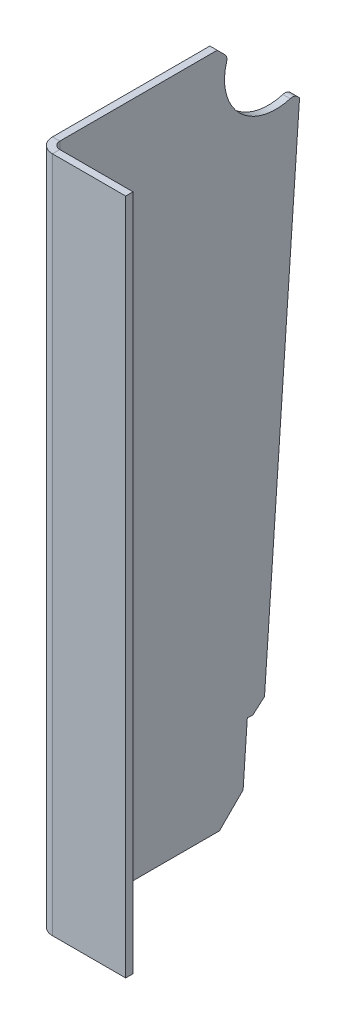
ISO-10303-21;
HEADER;
FILE_DESCRIPTION(('STEP AP214'),'2;1');
FILE_NAME('part.step','',(''),(''),'','','');
FILE_SCHEMA(('AUTOMOTIVE_DESIGN { 1 0 10303 214 1 1 1 1 }'));
ENDSEC;
DATA;
#1=APPLICATION_CONTEXT('core data for automotive mechanical design processes');
#2=APPLICATION_PROTOCOL_DEFINITION('international standard','automotive_design',2000,#1);
#3=PRODUCT_CONTEXT('',#1,'mechanical');
#4=PRODUCT('Part','Part','',(#3));
#5=PRODUCT_RELATED_PRODUCT_CATEGORY('part','',(#4));
#6=PRODUCT_DEFINITION_FORMATION('','',#4);
#7=PRODUCT_DEFINITION_CONTEXT('part definition',#1,'design');
#8=PRODUCT_DEFINITION('design','',#6,#7);
#9=PRODUCT_DEFINITION_SHAPE('','',#8);
#10=(LENGTH_UNIT() NAMED_UNIT(*) SI_UNIT(.MILLI.,.METRE.));
#11=(NAMED_UNIT(*) PLANE_ANGLE_UNIT() SI_UNIT($,.RADIAN.));
#12=(NAMED_UNIT(*) SI_UNIT($,.STERADIAN.) SOLID_ANGLE_UNIT());
#13=UNCERTAINTY_MEASURE_WITH_UNIT(LENGTH_MEASURE(1.E-05),#10,'distance_accuracy_value','');
#14=(GEOMETRIC_REPRESENTATION_CONTEXT(3) GLOBAL_UNCERTAINTY_ASSIGNED_CONTEXT((#13)) GLOBAL_UNIT_ASSIGNED_CONTEXT((#10,
#11,#12)) REPRESENTATION_CONTEXT('',''));
#15=CARTESIAN_POINT('',(0.,0.,0.));
#16=DIRECTION('',(0.,0.,1.));
#17=DIRECTION('',(1.,0.,0.));
#18=AXIS2_PLACEMENT_3D('',#15,#16,#17);
#19=CARTESIAN_POINT('',(6.35000000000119,587.375000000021,2.74780198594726E-12));
#20=DIRECTION('',(-1.,0.,0.));
#21=DIRECTION('',(0.,0.,1.));
#22=AXIS2_PLACEMENT_3D('',#19,#20,#21);
#23=PLANE('',#22);
#24=DIRECTION('',(0.,0.707106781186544,0.707106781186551));
#25=VECTOR('',#24,1.);
#26=CARTESIAN_POINT('',(6.3500000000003,661.9875,-74.6124999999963));
#27=LINE('',#26,#25);
#28=CARTESIAN_POINT('',(6.35000000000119,515.937500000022,-220.662499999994));
#29=VERTEX_POINT('',#28);
#30=CARTESIAN_POINT('',(6.35000000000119,517.734240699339,-218.865759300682));
#31=VERTEX_POINT('',#30);
#32=EDGE_CURVE('E162',#29,#31,#27,.T.);
#33=ORIENTED_EDGE('',*,*,#32,.T.);
#34=CARTESIAN_POINT('',(6.35000000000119,513.244112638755,-214.375631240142));
#35=DIRECTION('',(-1.,0.,0.));
#36=DIRECTION('',(0.,0.,1.));
#37=AXIS2_PLACEMENT_3D('',#34,#35,#36);
#38=CIRCLE('',#37,6.35);
#39=CARTESIAN_POINT('',(6.35000000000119,519.335473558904,-212.58180233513));
#40=VERTEX_POINT('',#39);
#41=EDGE_CURVE('E262',#31,#40,#38,.F.);
#42=ORIENTED_EDGE('',*,*,#41,.T.);
#43=CARTESIAN_POINT('',(6.3500000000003,561.975,-200.024999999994));
#44=DIRECTION('',(-1.,0.,0.));
#45=DIRECTION('',(0.,-1.,0.));
#46=AXIS2_PLACEMENT_3D('',#43,#44,#45);
#47=CIRCLE('',#46,44.450000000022);
#48=CARTESIAN_POINT('',(6.3500000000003,574.531802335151,-157.385473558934));
#49=VERTEX_POINT('',#48);
#50=EDGE_CURVE('E171',#40,#49,#47,.T.);
#51=ORIENTED_EDGE('',*,*,#50,.T.);
#52=CARTESIAN_POINT('',(6.3500000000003,576.325631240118,-151.294112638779));
#53=DIRECTION('',(-1.,0.,0.));
#54=DIRECTION('',(0.,0.,1.));
#55=AXIS2_PLACEMENT_3D('',#52,#53,#54);
#56=CIRCLE('',#55,6.35);
#57=CARTESIAN_POINT('',(6.3500000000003,580.815759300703,-155.784240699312));
#58=VERTEX_POINT('',#57);
#59=EDGE_CURVE('E161',#49,#58,#56,.F.);
#60=ORIENTED_EDGE('',*,*,#59,.T.);
#61=CARTESIAN_POINT('',(6.3500000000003,587.374999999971,-149.225));
#62=VERTEX_POINT('',#61);
#63=EDGE_CURVE('E154',#58,#62,#27,.T.);
#64=ORIENTED_EDGE('',*,*,#63,.T.);
#65=DIRECTION('',(0.,0.,-1.));
#66=VECTOR('',#65,1.);
#67=CARTESIAN_POINT('',(6.35000000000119,587.375000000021,2.74780198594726E-12));
#68=LINE('',#67,#66);
#69=CARTESIAN_POINT('',(6.35000000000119,587.375,-12.6999999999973));
#70=VERTEX_POINT('',#69);
#71=EDGE_CURVE('E159',#70,#62,#68,.T.);
#72=ORIENTED_EDGE('',*,*,#71,.F.);
#73=DIRECTION('',(0.,-1.,0.));
#74=VECTOR('',#73,1.);
#75=CARTESIAN_POINT('',(6.35000000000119,587.375,-12.6999999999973));
#76=LINE('',#75,#74);
#77=CARTESIAN_POINT('',(6.35000000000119,0.,-12.7000000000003));
#78=VERTEX_POINT('',#77);
#79=EDGE_CURVE('E201',#70,#78,#76,.T.);
#80=ORIENTED_EDGE('',*,*,#79,.T.);
#81=DIRECTION('',(0.,0.,-1.));
#82=VECTOR('',#81,1.);
#83=CARTESIAN_POINT('',(6.35000000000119,0.,-2.4980018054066E-13));
#84=LINE('',#83,#82);
#85=CARTESIAN_POINT('',(6.35000000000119,0.,-151.212246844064));
#86=VERTEX_POINT('',#85);
#87=EDGE_CURVE('E202',#78,#86,#84,.T.);
#88=ORIENTED_EDGE('',*,*,#87,.T.);
#89=DIRECTION('',(0.,-0.707106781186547,0.707106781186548));
#90=VECTOR('',#89,1.);
#91=CARTESIAN_POINT('',(6.35000000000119,20.4822590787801,-171.694505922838));
#92=LINE('',#91,#90);
#93=CARTESIAN_POINT('',(6.35000000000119,20.4822590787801,-171.694505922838));
#94=VERTEX_POINT('',#93);
#95=EDGE_CURVE('E247',#86,#94,#92,.F.);
#96=ORIENTED_EDGE('',*,*,#95,.T.);
#97=DIRECTION('',(0.,0.997564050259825,-0.0697564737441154));
#98=VECTOR('',#97,1.);
#99=CARTESIAN_POINT('',(6.3500000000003,572.668891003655,-210.307156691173));
#100=LINE('',#99,#98);
#101=CARTESIAN_POINT('',(6.35000000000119,72.8471147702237,-175.356213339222));
#102=VERTEX_POINT('',#101);
#103=EDGE_CURVE('E298',#94,#102,#100,.T.);
#104=ORIENTED_EDGE('',*,*,#103,.T.);
#105=DIRECTION('',(0.,-0.0697564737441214,-0.997564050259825));
#106=VECTOR('',#105,1.);
#107=CARTESIAN_POINT('',(6.35000000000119,87.5532237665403,34.9509433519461));
#108=LINE('',#107,#106);
#109=CARTESIAN_POINT('',(6.35000000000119,72.5148995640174,-180.107112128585));
#110=VERTEX_POINT('',#109);
#111=EDGE_CURVE('E304',#102,#110,#108,.T.);
#112=ORIENTED_EDGE('',*,*,#111,.T.);
#113=DIRECTION('',(0.,-0.656059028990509,0.754709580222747));
#114=VECTOR('',#113,1.);
#115=CARTESIAN_POINT('',(6.35000000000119,81.3522667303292,-190.273340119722));
#116=LINE('',#115,#114);
#117=CARTESIAN_POINT('',(6.35000000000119,81.3522667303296,-190.273340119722));
#118=VERTEX_POINT('',#117);
#119=EDGE_CURVE('E256',#110,#118,#116,.F.);
#120=ORIENTED_EDGE('',*,*,#119,.T.);
#121=DIRECTION('',(0.,0.997564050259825,-0.0697564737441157));
#122=VECTOR('',#121,1.);
#123=CARTESIAN_POINT('',(6.3500000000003,571.672245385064,-224.55985305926));
#124=LINE('',#123,#122);
#125=EDGE_CURVE('E285',#118,#29,#124,.T.);
#126=ORIENTED_EDGE('',*,*,#125,.T.);
#127=EDGE_LOOP('',(#33,#42,#51,#60,#64,#72,#80,#88,#96,#104,#112,#120,#126));
#128=FACE_BOUND('',#127,.T.);
#129=ADVANCED_FACE('F36',(#128),#23,.F.);
#130=CARTESIAN_POINT('',(0.,587.375000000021,2.99760216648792E-12));
#131=DIRECTION('',(-1.,0.,0.));
#132=DIRECTION('',(0.,0.,1.));
#133=AXIS2_PLACEMENT_3D('',#130,#131,#132);
#134=PLANE('',#133);
#135=CARTESIAN_POINT('',(-8.88178419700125E-13,561.975,-200.024999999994));
#136=DIRECTION('',(-1.,0.,0.));
#137=DIRECTION('',(0.,-1.,0.));
#138=AXIS2_PLACEMENT_3D('',#135,#136,#137);
#139=CIRCLE('',#138,44.450000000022);
#140=CARTESIAN_POINT('',(0.,519.335473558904,-212.58180233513));
#141=VERTEX_POINT('',#140);
#142=CARTESIAN_POINT('',(-8.88178419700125E-13,574.531802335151,-157.385473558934));
#143=VERTEX_POINT('',#142);
#144=EDGE_CURVE('E275',#141,#143,#139,.T.);
#145=ORIENTED_EDGE('',*,*,#144,.F.);
#146=CARTESIAN_POINT('',(0.,513.244112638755,-214.375631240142));
#147=DIRECTION('',(-1.,0.,0.));
#148=DIRECTION('',(0.,0.,1.));
#149=AXIS2_PLACEMENT_3D('',#146,#147,#148);
#150=CIRCLE('',#149,6.35);
#151=CARTESIAN_POINT('',(0.,517.734240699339,-218.865759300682));
#152=VERTEX_POINT('',#151);
#153=EDGE_CURVE('E44',#141,#152,#150,.T.);
#154=ORIENTED_EDGE('',*,*,#153,.T.);
#155=DIRECTION('',(0.,0.707106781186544,0.707106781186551));
#156=VECTOR('',#155,1.);
#157=CARTESIAN_POINT('',(-8.88178419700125E-13,661.9875,-74.6124999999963));
#158=LINE('',#157,#156);
#159=CARTESIAN_POINT('',(0.,515.937500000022,-220.662499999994));
#160=VERTEX_POINT('',#159);
#161=EDGE_CURVE('E274',#160,#152,#158,.T.);
#162=ORIENTED_EDGE('',*,*,#161,.F.);
#163=DIRECTION('',(0.,0.997564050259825,-0.0697564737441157));
#164=VECTOR('',#163,1.);
#165=CARTESIAN_POINT('',(-8.88178419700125E-13,571.672245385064,-224.55985305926));
#166=LINE('',#165,#164);
#167=CARTESIAN_POINT('',(0.,81.3522667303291,-190.273340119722));
#168=VERTEX_POINT('',#167);
#169=EDGE_CURVE('E295',#168,#160,#166,.T.);
#170=ORIENTED_EDGE('',*,*,#169,.F.);
#171=DIRECTION('',(0.,0.656059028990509,-0.754709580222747));
#172=VECTOR('',#171,1.);
#173=CARTESIAN_POINT('',(0.,204.940450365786,-332.445282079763));
#174=LINE('',#173,#172);
#175=CARTESIAN_POINT('',(0.,72.5148995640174,-180.107112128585));
#176=VERTEX_POINT('',#175);
#177=EDGE_CURVE('E252',#168,#176,#174,.F.);
#178=ORIENTED_EDGE('',*,*,#177,.T.);
#179=DIRECTION('',(0.,-0.0697564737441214,-0.997564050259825));
#180=VECTOR('',#179,1.);
#181=CARTESIAN_POINT('',(0.,87.5532237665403,34.9509433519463));
#182=LINE('',#181,#180);
#183=CARTESIAN_POINT('',(0.,72.8471147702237,-175.356213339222));
#184=VERTEX_POINT('',#183);
#185=EDGE_CURVE('E297',#184,#176,#182,.T.);
#186=ORIENTED_EDGE('',*,*,#185,.F.);
#187=DIRECTION('',(0.,0.997564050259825,-0.0697564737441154));
#188=VECTOR('',#187,1.);
#189=CARTESIAN_POINT('',(-8.88178419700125E-13,572.668891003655,-210.307156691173));
#190=LINE('',#189,#188);
#191=CARTESIAN_POINT('',(0.,20.4822590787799,-171.694505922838));
#192=VERTEX_POINT('',#191);
#193=EDGE_CURVE('E299',#192,#184,#190,.T.);
#194=ORIENTED_EDGE('',*,*,#193,.F.);
#195=DIRECTION('',(0.,0.707106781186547,-0.707106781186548));
#196=VECTOR('',#195,1.);
#197=CARTESIAN_POINT('',(0.,218.081376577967,-369.293623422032));
#198=LINE('',#197,#196);
#199=CARTESIAN_POINT('',(0.,0.,-151.212246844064));
#200=VERTEX_POINT('',#199);
#201=EDGE_CURVE('E243',#192,#200,#198,.F.);
#202=ORIENTED_EDGE('',*,*,#201,.T.);
#203=DIRECTION('',(0.,0.,-1.));
#204=VECTOR('',#203,1.);
#205=CARTESIAN_POINT('',(0.,0.,0.));
#206=LINE('',#205,#204);
#207=CARTESIAN_POINT('',(0.,0.,-12.7));
#208=VERTEX_POINT('',#207);
#209=EDGE_CURVE('E205',#208,#200,#206,.T.);
#210=ORIENTED_EDGE('',*,*,#209,.F.);
#211=DIRECTION('',(0.,-1.,0.));
#212=VECTOR('',#211,1.);
#213=CARTESIAN_POINT('',(0.,587.375,-12.699999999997));
#214=LINE('',#213,#212);
#215=CARTESIAN_POINT('',(0.,587.375,-12.699999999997));
#216=VERTEX_POINT('',#215);
#217=EDGE_CURVE('E230',#216,#208,#214,.T.);
#218=ORIENTED_EDGE('',*,*,#217,.F.);
#219=DIRECTION('',(0.,0.,-1.));
#220=VECTOR('',#219,1.);
#221=CARTESIAN_POINT('',(0.,587.375000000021,2.99760216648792E-12));
#222=LINE('',#221,#220);
#223=CARTESIAN_POINT('',(-8.88178419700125E-13,587.374999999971,-149.225));
#224=VERTEX_POINT('',#223);
#225=EDGE_CURVE('E176',#216,#224,#222,.T.);
#226=ORIENTED_EDGE('',*,*,#225,.T.);
#227=CARTESIAN_POINT('',(-8.88178419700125E-13,580.815759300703,-155.784240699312));
#228=VERTEX_POINT('',#227);
#229=EDGE_CURVE('E167',#228,#224,#158,.T.);
#230=ORIENTED_EDGE('',*,*,#229,.F.);
#231=CARTESIAN_POINT('',(-8.88178419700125E-13,576.325631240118,-151.294112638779));
#232=DIRECTION('',(-1.,0.,0.));
#233=DIRECTION('',(0.,0.,1.));
#234=AXIS2_PLACEMENT_3D('',#231,#232,#233);
#235=CIRCLE('',#234,6.35);
#236=EDGE_CURVE('E56',#228,#143,#235,.T.);
#237=ORIENTED_EDGE('',*,*,#236,.T.);
#238=EDGE_LOOP('',(#145,#154,#162,#170,#178,#186,#194,#202,#210,#218,#226,#230,#237));
#239=FACE_BOUND('',#238,.T.);
#240=ADVANCED_FACE('F272',(#239),#134,.T.);
#241=CARTESIAN_POINT('',(6.3500000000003,661.9875,-74.6124999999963));
#242=DIRECTION('',(0.,-0.707106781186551,0.707106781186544));
#243=DIRECTION('',(0.,0.707106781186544,0.707106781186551));
#244=AXIS2_PLACEMENT_3D('',#241,#242,#243);
#245=PLANE('',#244);
#246=ORIENTED_EDGE('',*,*,#63,.F.);
#247=DIRECTION('',(1.,0.,0.));
#248=VECTOR('',#247,1.);
#249=CARTESIAN_POINT('',(6.3500000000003,580.815759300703,-155.784240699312));
#250=LINE('',#249,#248);
#251=EDGE_CURVE('E11',#58,#228,#250,.F.);
#252=ORIENTED_EDGE('',*,*,#251,.T.);
#253=ORIENTED_EDGE('',*,*,#229,.T.);
#254=DIRECTION('',(1.,0.,0.));
#255=VECTOR('',#254,1.);
#256=CARTESIAN_POINT('',(6.3500000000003,587.374999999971,-149.225));
#257=LINE('',#256,#255);
#258=EDGE_CURVE('E163',#62,#224,#257,.F.);
#259=ORIENTED_EDGE('',*,*,#258,.F.);
#260=EDGE_LOOP('',(#246,#252,#253,#259));
#261=FACE_BOUND('',#260,.T.);
#262=ADVANCED_FACE('F166',(#261),#245,.F.);
#263=ORIENTED_EDGE('',*,*,#161,.T.);
#264=DIRECTION('',(1.,0.,0.));
#265=VECTOR('',#264,1.);
#266=CARTESIAN_POINT('',(6.35000000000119,517.734240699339,-218.865759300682));
#267=LINE('',#266,#265);
#268=EDGE_CURVE('E258',#152,#31,#267,.T.);
#269=ORIENTED_EDGE('',*,*,#268,.T.);
#270=ORIENTED_EDGE('',*,*,#32,.F.);
#271=DIRECTION('',(1.,0.,0.));
#272=VECTOR('',#271,1.);
#273=CARTESIAN_POINT('',(6.35000000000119,515.937500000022,-220.662499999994));
#274=LINE('',#273,#272);
#275=EDGE_CURVE('E284',#29,#160,#274,.F.);
#276=ORIENTED_EDGE('',*,*,#275,.T.);
#277=EDGE_LOOP('',(#263,#269,#270,#276));
#278=FACE_BOUND('',#277,.T.);
#279=ADVANCED_FACE('F281',(#278),#245,.F.);
#280=CARTESIAN_POINT('',(12.7000000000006,587.375000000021,-6.3499999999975));
#281=DIRECTION('',(0.,1.,0.));
#282=DIRECTION('',(0.,0.,1.));
#283=AXIS2_PLACEMENT_3D('',#280,#281,#282);
#284=PLANE('',#283);
#285=ORIENTED_EDGE('',*,*,#71,.T.);
#286=ORIENTED_EDGE('',*,*,#258,.T.);
#287=ORIENTED_EDGE('',*,*,#225,.F.);
#288=DIRECTION('',(1.,0.,0.));
#289=VECTOR('',#288,1.);
#290=CARTESIAN_POINT('',(0.,587.375,-12.699999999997));
#291=LINE('',#290,#289);
#292=EDGE_CURVE('E174',#216,#70,#291,.T.);
#293=ORIENTED_EDGE('',*,*,#292,.T.);
#294=EDGE_LOOP('',(#285,#286,#287,#293));
#295=FACE_BOUND('',#294,.T.);
#296=ADVANCED_FACE('F173',(#295),#284,.T.);
#297=CARTESIAN_POINT('',(12.7000000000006,0.,-12.7000000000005));
#298=DIRECTION('',(0.,1.,0.));
#299=DIRECTION('',(1.,0.,0.));
#300=AXIS2_PLACEMENT_3D('',#297,#298,#299);
#301=PLANE('',#300);
#302=ORIENTED_EDGE('',*,*,#209,.T.);
#303=DIRECTION('',(1.,0.,0.));
#304=VECTOR('',#303,1.);
#305=CARTESIAN_POINT('',(6.35000000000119,0.,-151.212246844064));
#306=LINE('',#305,#304);
#307=EDGE_CURVE('E245',#200,#86,#306,.T.);
#308=ORIENTED_EDGE('',*,*,#307,.T.);
#309=ORIENTED_EDGE('',*,*,#87,.F.);
#310=DIRECTION('',(-1.,0.,0.));
#311=VECTOR('',#310,1.);
#312=CARTESIAN_POINT('',(6.35000000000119,0.,-12.7000000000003));
#313=LINE('',#312,#311);
#314=EDGE_CURVE('E233',#78,#208,#313,.T.);
#315=ORIENTED_EDGE('',*,*,#314,.T.);
#316=EDGE_LOOP('',(#302,#308,#309,#315));
#317=FACE_BOUND('',#316,.T.);
#318=ADVANCED_FACE('F333',(#317),#301,.F.);
#319=CARTESIAN_POINT('',(0.,587.375,-12.699999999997));
#320=DIRECTION('',(0.,1.,0.));
#321=DIRECTION('',(0.,0.,1.));
#322=AXIS2_PLACEMENT_3D('',#319,#320,#321);
#323=PLANE('',#322);
#324=ORIENTED_EDGE('',*,*,#292,.F.);
#325=CARTESIAN_POINT('',(12.7000000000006,587.375,-12.6999999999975));
#326=DIRECTION('',(0.,1.,0.));
#327=DIRECTION('',(0.,0.,1.));
#328=AXIS2_PLACEMENT_3D('',#325,#326,#327);
#329=CIRCLE('',#328,12.7);
#330=CARTESIAN_POINT('',(12.7000000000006,587.375000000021,2.4980018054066E-12));
#331=VERTEX_POINT('',#330);
#332=EDGE_CURVE('E179',#331,#216,#329,.F.);
#333=ORIENTED_EDGE('',*,*,#332,.F.);
#334=DIRECTION('',(0.,0.,1.));
#335=VECTOR('',#334,1.);
#336=CARTESIAN_POINT('',(12.7000000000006,587.375000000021,-6.3499999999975));
#337=LINE('',#336,#335);
#338=CARTESIAN_POINT('',(12.7000000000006,587.375000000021,-6.3499999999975));
#339=VERTEX_POINT('',#338);
#340=EDGE_CURVE('E237',#339,#331,#337,.T.);
#341=ORIENTED_EDGE('',*,*,#340,.F.);
#342=CARTESIAN_POINT('',(12.7000000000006,587.375,-12.6999999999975));
#343=DIRECTION('',(0.,1.,0.));
#344=DIRECTION('',(1.,0.,0.));
#345=AXIS2_PLACEMENT_3D('',#342,#343,#344);
#346=CIRCLE('',#345,6.35);
#347=EDGE_CURVE('E199',#339,#70,#346,.F.);
#348=ORIENTED_EDGE('',*,*,#347,.T.);
#349=EDGE_LOOP('',(#324,#333,#341,#348));
#350=FACE_BOUND('',#349,.T.);
#351=ADVANCED_FACE('F362',(#350),#323,.T.);
#352=CARTESIAN_POINT('',(12.6999999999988,0.,-4.9960036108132E-13));
#353=DIRECTION('',(0.,-1.,0.));
#354=DIRECTION('',(0.,0.,-1.));
#355=AXIS2_PLACEMENT_3D('',#352,#353,#354);
#356=PLANE('',#355);
#357=DIRECTION('',(0.,0.,-1.));
#358=VECTOR('',#357,1.);
#359=CARTESIAN_POINT('',(12.6999999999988,0.,-4.9960036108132E-13));
#360=LINE('',#359,#358);
#361=CARTESIAN_POINT('',(12.6999999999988,0.,-4.9960036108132E-13));
#362=VERTEX_POINT('',#361);
#363=CARTESIAN_POINT('',(12.6999999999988,2.39808173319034E-11,-6.35000000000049));
#364=VERTEX_POINT('',#363);
#365=EDGE_CURVE('E235',#362,#364,#360,.T.);
#366=ORIENTED_EDGE('',*,*,#365,.F.);
#367=CARTESIAN_POINT('',(12.7000000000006,0.,-12.7000000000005));
#368=DIRECTION('',(0.,1.,0.));
#369=DIRECTION('',(0.,0.,1.));
#370=AXIS2_PLACEMENT_3D('',#367,#368,#369);
#371=CIRCLE('',#370,12.7);
#372=EDGE_CURVE('E208',#362,#208,#371,.F.);
#373=ORIENTED_EDGE('',*,*,#372,.T.);
#374=ORIENTED_EDGE('',*,*,#314,.F.);
#375=CARTESIAN_POINT('',(12.7000000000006,0.,-12.7000000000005));
#376=DIRECTION('',(0.,1.,0.));
#377=DIRECTION('',(1.,0.,0.));
#378=AXIS2_PLACEMENT_3D('',#375,#376,#377);
#379=CIRCLE('',#378,6.35);
#380=EDGE_CURVE('E177',#364,#78,#379,.F.);
#381=ORIENTED_EDGE('',*,*,#380,.F.);
#382=EDGE_LOOP('',(#366,#373,#374,#381));
#383=FACE_BOUND('',#382,.T.);
#384=ADVANCED_FACE('F358',(#383),#356,.T.);
#385=CARTESIAN_POINT('',(6.35000000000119,0.,-12.7000000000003));
#386=DIRECTION('',(0.,-1.,0.));
#387=DIRECTION('',(0.,0.,-1.));
#388=AXIS2_PLACEMENT_3D('',#385,#386,#387);
#389=PLANE('',#388);
#390=DIRECTION('',(-1.,0.,0.));
#391=VECTOR('',#390,1.);
#392=CARTESIAN_POINT('',(0.,0.,0.));
#393=LINE('',#392,#391);
#394=CARTESIAN_POINT('',(76.2,3.99680288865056E-12,9.99200722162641E-13));
#395=VERTEX_POINT('',#394);
#396=EDGE_CURVE('E211',#395,#362,#393,.T.);
#397=ORIENTED_EDGE('',*,*,#396,.T.);
#398=ORIENTED_EDGE('',*,*,#365,.T.);
#399=DIRECTION('',(1.,0.,0.));
#400=VECTOR('',#399,1.);
#401=CARTESIAN_POINT('',(0.,2.39808173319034E-11,-6.34999999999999));
#402=LINE('',#401,#400);
#403=CARTESIAN_POINT('',(76.2,3.99680288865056E-12,-6.34999999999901));
#404=VERTEX_POINT('',#403);
#405=EDGE_CURVE('E182',#404,#364,#402,.F.);
#406=ORIENTED_EDGE('',*,*,#405,.F.);
#407=DIRECTION('',(0.,0.,1.));
#408=VECTOR('',#407,1.);
#409=CARTESIAN_POINT('',(76.2,3.99680288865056E-12,-6.34999999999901));
#410=LINE('',#409,#408);
#411=EDGE_CURVE('E214',#404,#395,#410,.T.);
#412=ORIENTED_EDGE('',*,*,#411,.T.);
#413=EDGE_LOOP('',(#397,#398,#406,#412));
#414=FACE_BOUND('',#413,.T.);
#415=ADVANCED_FACE('F355',(#414),#389,.T.);
#416=CARTESIAN_POINT('',(12.7000000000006,587.375,-12.6999999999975));
#417=DIRECTION('',(0.,-1.,0.));
#418=DIRECTION('',(0.,0.,-1.));
#419=AXIS2_PLACEMENT_3D('',#416,#417,#418);
#420=CYLINDRICAL_SURFACE('',#419,12.7);
#421=ORIENTED_EDGE('',*,*,#372,.F.);
#422=DIRECTION('',(0.,-1.,0.));
#423=VECTOR('',#422,1.);
#424=CARTESIAN_POINT('',(12.7000000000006,587.375000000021,2.4980018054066E-12));
#425=LINE('',#424,#423);
#426=EDGE_CURVE('E227',#331,#362,#425,.T.);
#427=ORIENTED_EDGE('',*,*,#426,.F.);
#428=ORIENTED_EDGE('',*,*,#332,.T.);
#429=ORIENTED_EDGE('',*,*,#217,.T.);
#430=EDGE_LOOP('',(#421,#427,#428,#429));
#431=FACE_BOUND('',#430,.T.);
#432=ADVANCED_FACE('F339',(#431),#420,.T.);
#433=CARTESIAN_POINT('',(0.,587.375000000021,2.99760216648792E-12));
#434=DIRECTION('',(0.,0.,1.));
#435=DIRECTION('',(1.,0.,0.));
#436=AXIS2_PLACEMENT_3D('',#433,#434,#435);
#437=PLANE('',#436);
#438=ORIENTED_EDGE('',*,*,#396,.F.);
#439=DIRECTION('',(0.,-1.,0.));
#440=VECTOR('',#439,1.);
#441=CARTESIAN_POINT('',(76.2,587.375000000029,3.99680288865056E-12));
#442=LINE('',#441,#440);
#443=CARTESIAN_POINT('',(76.2,587.375000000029,3.99680288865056E-12));
#444=VERTEX_POINT('',#443);
#445=EDGE_CURVE('E225',#444,#395,#442,.T.);
#446=ORIENTED_EDGE('',*,*,#445,.F.);
#447=DIRECTION('',(-1.,0.,0.));
#448=VECTOR('',#447,1.);
#449=CARTESIAN_POINT('',(0.,587.375000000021,2.99760216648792E-12));
#450=LINE('',#449,#448);
#451=EDGE_CURVE('E190',#444,#331,#450,.T.);
#452=ORIENTED_EDGE('',*,*,#451,.T.);
#453=ORIENTED_EDGE('',*,*,#426,.T.);
#454=EDGE_LOOP('',(#438,#446,#452,#453));
#455=FACE_BOUND('',#454,.T.);
#456=ADVANCED_FACE('F403',(#455),#437,.T.);
#457=CARTESIAN_POINT('',(76.2,587.375000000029,-6.34999999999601));
#458=DIRECTION('',(1.,0.,0.));
#459=DIRECTION('',(0.,0.,-1.));
#460=AXIS2_PLACEMENT_3D('',#457,#458,#459);
#461=PLANE('',#460);
#462=ORIENTED_EDGE('',*,*,#411,.F.);
#463=DIRECTION('',(0.,-1.,0.));
#464=VECTOR('',#463,1.);
#465=CARTESIAN_POINT('',(76.2,587.375000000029,-6.34999999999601));
#466=LINE('',#465,#464);
#467=CARTESIAN_POINT('',(76.2,587.375000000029,-6.34999999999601));
#468=VERTEX_POINT('',#467);
#469=EDGE_CURVE('E223',#468,#404,#466,.T.);
#470=ORIENTED_EDGE('',*,*,#469,.F.);
#471=DIRECTION('',(0.,0.,1.));
#472=VECTOR('',#471,1.);
#473=CARTESIAN_POINT('',(76.2,587.375000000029,-6.34999999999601));
#474=LINE('',#473,#472);
#475=EDGE_CURVE('E193',#468,#444,#474,.T.);
#476=ORIENTED_EDGE('',*,*,#475,.T.);
#477=ORIENTED_EDGE('',*,*,#445,.T.);
#478=EDGE_LOOP('',(#462,#470,#476,#477));
#479=FACE_BOUND('',#478,.T.);
#480=ADVANCED_FACE('F399',(#479),#461,.T.);
#481=CARTESIAN_POINT('',(0.,587.375000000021,-6.349999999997));
#482=DIRECTION('',(0.,0.,1.));
#483=DIRECTION('',(1.,0.,0.));
#484=AXIS2_PLACEMENT_3D('',#481,#482,#483);
#485=PLANE('',#484);
#486=ORIENTED_EDGE('',*,*,#405,.T.);
#487=DIRECTION('',(0.,-1.,0.));
#488=VECTOR('',#487,1.);
#489=CARTESIAN_POINT('',(12.7000000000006,587.375000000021,-6.3499999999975));
#490=LINE('',#489,#488);
#491=EDGE_CURVE('E220',#339,#364,#490,.T.);
#492=ORIENTED_EDGE('',*,*,#491,.F.);
#493=DIRECTION('',(1.,0.,0.));
#494=VECTOR('',#493,1.);
#495=CARTESIAN_POINT('',(0.,587.375000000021,-6.349999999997));
#496=LINE('',#495,#494);
#497=EDGE_CURVE('E196',#468,#339,#496,.F.);
#498=ORIENTED_EDGE('',*,*,#497,.F.);
#499=ORIENTED_EDGE('',*,*,#469,.T.);
#500=EDGE_LOOP('',(#486,#492,#498,#499));
#501=FACE_BOUND('',#500,.T.);
#502=ADVANCED_FACE('F395',(#501),#485,.F.);
#503=CARTESIAN_POINT('',(12.7000000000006,587.375,-12.6999999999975));
#504=DIRECTION('',(0.,-1.,0.));
#505=DIRECTION('',(0.,0.,-1.));
#506=AXIS2_PLACEMENT_3D('',#503,#504,#505);
#507=CYLINDRICAL_SURFACE('',#506,6.35);
#508=ORIENTED_EDGE('',*,*,#380,.T.);
#509=ORIENTED_EDGE('',*,*,#79,.F.);
#510=ORIENTED_EDGE('',*,*,#347,.F.);
#511=ORIENTED_EDGE('',*,*,#491,.T.);
#512=EDGE_LOOP('',(#508,#509,#510,#511));
#513=FACE_BOUND('',#512,.T.);
#514=ADVANCED_FACE('F389',(#513),#507,.F.);
#515=CARTESIAN_POINT('',(12.7000000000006,587.375,-12.6999999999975));
#516=DIRECTION('',(0.,1.,0.));
#517=DIRECTION('',(1.,0.,0.));
#518=AXIS2_PLACEMENT_3D('',#515,#516,#517);
#519=PLANE('',#518);
#520=ORIENTED_EDGE('',*,*,#497,.T.);
#521=ORIENTED_EDGE('',*,*,#340,.T.);
#522=ORIENTED_EDGE('',*,*,#451,.F.);
#523=ORIENTED_EDGE('',*,*,#475,.F.);
#524=EDGE_LOOP('',(#520,#521,#522,#523));
#525=FACE_BOUND('',#524,.T.);
#526=ADVANCED_FACE('F384',(#525),#519,.T.);
#527=CARTESIAN_POINT('',(6.3500000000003,572.668891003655,-210.307156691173));
#528=DIRECTION('',(0.,0.0697564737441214,0.997564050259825));
#529=DIRECTION('',(0.,0.997564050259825,-0.0697564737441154));
#530=AXIS2_PLACEMENT_3D('',#527,#528,#529);
#531=PLANE('',#530);
#532=ORIENTED_EDGE('',*,*,#103,.F.);
#533=DIRECTION('',(1.,0.,0.));
#534=VECTOR('',#533,1.);
#535=CARTESIAN_POINT('',(0.,20.4822590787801,-171.694505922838));
#536=LINE('',#535,#534);
#537=EDGE_CURVE('E240',#94,#192,#536,.F.);
#538=ORIENTED_EDGE('',*,*,#537,.T.);
#539=ORIENTED_EDGE('',*,*,#193,.T.);
#540=DIRECTION('',(1.,0.,0.));
#541=VECTOR('',#540,1.);
#542=CARTESIAN_POINT('',(6.35000000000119,72.8471147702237,-175.356213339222));
#543=LINE('',#542,#541);
#544=EDGE_CURVE('E185',#102,#184,#543,.F.);
#545=ORIENTED_EDGE('',*,*,#544,.F.);
#546=EDGE_LOOP('',(#532,#538,#539,#545));
#547=FACE_BOUND('',#546,.T.);
#548=ADVANCED_FACE('F326',(#547),#531,.F.);
#549=CARTESIAN_POINT('',(6.3500000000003,571.672245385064,-224.55985305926));
#550=DIRECTION('',(0.,0.0697564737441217,0.997564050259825));
#551=DIRECTION('',(0.,0.997564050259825,-0.0697564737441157));
#552=AXIS2_PLACEMENT_3D('',#549,#550,#551);
#553=PLANE('',#552);
#554=ORIENTED_EDGE('',*,*,#125,.F.);
#555=DIRECTION('',(1.,0.,0.));
#556=VECTOR('',#555,1.);
#557=CARTESIAN_POINT('',(6.35000000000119,81.3522667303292,-190.273340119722));
#558=LINE('',#557,#556);
#559=EDGE_CURVE('E249',#118,#168,#558,.F.);
#560=ORIENTED_EDGE('',*,*,#559,.T.);
#561=ORIENTED_EDGE('',*,*,#169,.T.);
#562=ORIENTED_EDGE('',*,*,#275,.F.);
#563=EDGE_LOOP('',(#554,#560,#561,#562));
#564=FACE_BOUND('',#563,.T.);
#565=ADVANCED_FACE('F323',(#564),#553,.F.);
#566=CARTESIAN_POINT('',(6.35000000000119,87.5532237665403,34.9509433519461));
#567=DIRECTION('',(0.,0.997564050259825,-0.0697564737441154));
#568=DIRECTION('',(0.,-0.0697564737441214,-0.997564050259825));
#569=AXIS2_PLACEMENT_3D('',#566,#567,#568);
#570=PLANE('',#569);
#571=ORIENTED_EDGE('',*,*,#185,.T.);
#572=DIRECTION('',(-1.,0.,0.));
#573=VECTOR('',#572,1.);
#574=CARTESIAN_POINT('',(6.35000000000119,72.5148995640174,-180.107112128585));
#575=LINE('',#574,#573);
#576=EDGE_CURVE('E254',#176,#110,#575,.F.);
#577=ORIENTED_EDGE('',*,*,#576,.T.);
#578=ORIENTED_EDGE('',*,*,#111,.F.);
#579=ORIENTED_EDGE('',*,*,#544,.T.);
#580=EDGE_LOOP('',(#571,#577,#578,#579));
#581=FACE_BOUND('',#580,.T.);
#582=ADVANCED_FACE('F312',(#581),#570,.F.);
#583=CARTESIAN_POINT('',(6.35000000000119,20.4822590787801,-171.694505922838));
#584=DIRECTION('',(0.,0.707106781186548,0.707106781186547));
#585=DIRECTION('',(0.,-0.707106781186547,0.707106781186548));
#586=AXIS2_PLACEMENT_3D('',#583,#584,#585);
#587=PLANE('',#586);
#588=ORIENTED_EDGE('',*,*,#95,.F.);
#589=ORIENTED_EDGE('',*,*,#307,.F.);
#590=ORIENTED_EDGE('',*,*,#201,.F.);
#591=ORIENTED_EDGE('',*,*,#537,.F.);
#592=EDGE_LOOP('',(#588,#589,#590,#591));
#593=FACE_BOUND('',#592,.T.);
#594=ADVANCED_FACE('F328',(#593),#587,.F.);
#595=CARTESIAN_POINT('',(6.35000000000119,81.3522667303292,-190.273340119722));
#596=DIRECTION('',(0.,0.754709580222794,0.656059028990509));
#597=DIRECTION('',(0.,-0.656059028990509,0.754709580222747));
#598=AXIS2_PLACEMENT_3D('',#595,#596,#597);
#599=PLANE('',#598);
#600=ORIENTED_EDGE('',*,*,#119,.F.);
#601=ORIENTED_EDGE('',*,*,#576,.F.);
#602=ORIENTED_EDGE('',*,*,#177,.F.);
#603=ORIENTED_EDGE('',*,*,#559,.F.);
#604=EDGE_LOOP('',(#600,#601,#602,#603));
#605=FACE_BOUND('',#604,.T.);
#606=ADVANCED_FACE('F320',(#605),#599,.F.);
#607=CARTESIAN_POINT('',(-8.88178419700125E-13,561.975,-200.024999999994));
#608=DIRECTION('',(-1.,0.,0.));
#609=DIRECTION('',(0.,-1.,0.));
#610=AXIS2_PLACEMENT_3D('',#607,#608,#609);
#611=CYLINDRICAL_SURFACE('',#610,44.450000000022);
#612=ORIENTED_EDGE('',*,*,#50,.F.);
#613=DIRECTION('',(-1.,0.,0.));
#614=VECTOR('',#613,1.);
#615=CARTESIAN_POINT('',(0.,519.335473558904,-212.58180233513));
#616=LINE('',#615,#614);
#617=EDGE_CURVE('E267',#40,#141,#616,.T.);
#618=ORIENTED_EDGE('',*,*,#617,.T.);
#619=ORIENTED_EDGE('',*,*,#144,.T.);
#620=DIRECTION('',(-1.,0.,0.));
#621=VECTOR('',#620,1.);
#622=CARTESIAN_POINT('',(-8.88178419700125E-13,574.531802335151,-157.385473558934));
#623=LINE('',#622,#621);
#624=EDGE_CURVE('E264',#143,#49,#623,.F.);
#625=ORIENTED_EDGE('',*,*,#624,.T.);
#626=EDGE_LOOP('',(#612,#618,#619,#625));
#627=FACE_BOUND('',#626,.T.);
#628=ADVANCED_FACE('F290',(#627),#611,.F.);
#629=CARTESIAN_POINT('',(0.,513.244112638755,-214.375631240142));
#630=DIRECTION('',(-1.,0.,0.));
#631=DIRECTION('',(0.,-1.,0.));
#632=AXIS2_PLACEMENT_3D('',#629,#630,#631);
#633=CYLINDRICAL_SURFACE('',#632,6.35);
#634=ORIENTED_EDGE('',*,*,#153,.F.);
#635=ORIENTED_EDGE('',*,*,#617,.F.);
#636=ORIENTED_EDGE('',*,*,#41,.F.);
#637=ORIENTED_EDGE('',*,*,#268,.F.);
#638=EDGE_LOOP('',(#634,#635,#636,#637));
#639=FACE_BOUND('',#638,.T.);
#640=ADVANCED_FACE('F287',(#639),#633,.T.);
#641=CARTESIAN_POINT('',(-8.88178419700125E-13,576.325631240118,-151.294112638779));
#642=DIRECTION('',(-1.,0.,0.));
#643=DIRECTION('',(0.,-1.,0.));
#644=AXIS2_PLACEMENT_3D('',#641,#642,#643);
#645=CYLINDRICAL_SURFACE('',#644,6.35);
#646=ORIENTED_EDGE('',*,*,#236,.F.);
#647=ORIENTED_EDGE('',*,*,#251,.F.);
#648=ORIENTED_EDGE('',*,*,#59,.F.);
#649=ORIENTED_EDGE('',*,*,#624,.F.);
#650=EDGE_LOOP('',(#646,#647,#648,#649));
#651=FACE_BOUND('',#650,.T.);
#652=ADVANCED_FACE('F38',(#651),#645,.T.);
#653=CLOSED_SHELL('',(#129,#240,#262,#279,#296,#318,#351,#384,#415,#432,#456,#480,#502,#514,
#526,#548,#565,#582,#594,#606,#628,#640,#652));
#654=MANIFOLD_SOLID_BREP('B2',#653);
#655=ADVANCED_BREP_SHAPE_REPRESENTATION('',(#18,#654),#14);
#656=SHAPE_DEFINITION_REPRESENTATION(#9,#655);
ENDSEC;
END-ISO-10303-21;
